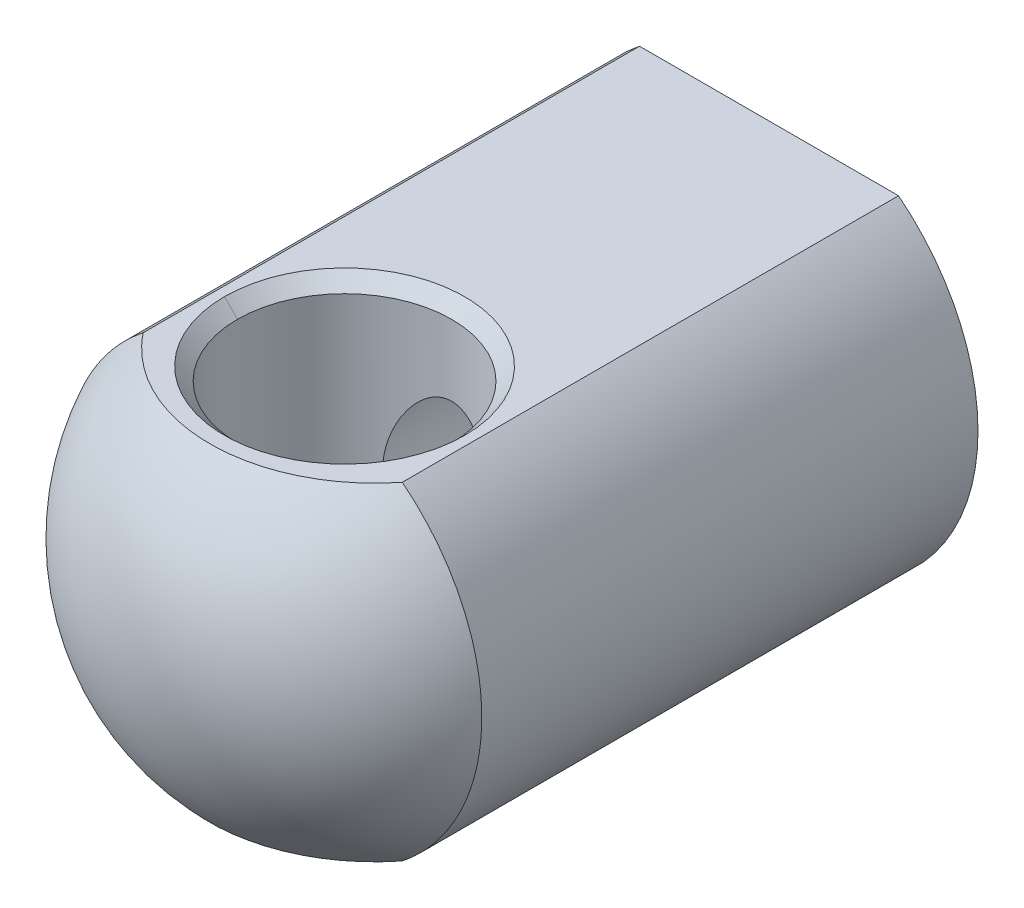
ISO-10303-21;
HEADER;
FILE_DESCRIPTION(('STEP AP214'),'2;1');
FILE_NAME('part.step','',(''),(''),'','','');
FILE_SCHEMA(('AUTOMOTIVE_DESIGN { 1 0 10303 214 1 1 1 1 }'));
ENDSEC;
DATA;
#1=APPLICATION_CONTEXT('core data for automotive mechanical design processes');
#2=APPLICATION_PROTOCOL_DEFINITION('international standard','automotive_design',2000,#1);
#3=PRODUCT_CONTEXT('',#1,'mechanical');
#4=PRODUCT('Part','Part','',(#3));
#5=PRODUCT_RELATED_PRODUCT_CATEGORY('part','',(#4));
#6=PRODUCT_DEFINITION_FORMATION('','',#4);
#7=PRODUCT_DEFINITION_CONTEXT('part definition',#1,'design');
#8=PRODUCT_DEFINITION('design','',#6,#7);
#9=PRODUCT_DEFINITION_SHAPE('','',#8);
#10=(LENGTH_UNIT() NAMED_UNIT(*) SI_UNIT(.MILLI.,.METRE.));
#11=(NAMED_UNIT(*) PLANE_ANGLE_UNIT() SI_UNIT($,.RADIAN.));
#12=(NAMED_UNIT(*) SI_UNIT($,.STERADIAN.) SOLID_ANGLE_UNIT());
#13=UNCERTAINTY_MEASURE_WITH_UNIT(LENGTH_MEASURE(1.E-05),#10,'distance_accuracy_value','');
#14=(GEOMETRIC_REPRESENTATION_CONTEXT(3) GLOBAL_UNCERTAINTY_ASSIGNED_CONTEXT((#13)) GLOBAL_UNIT_ASSIGNED_CONTEXT((#10,
#11,#12)) REPRESENTATION_CONTEXT('',''));
#15=CARTESIAN_POINT('',(0.,0.,0.));
#16=DIRECTION('',(0.,0.,1.));
#17=DIRECTION('',(1.,0.,0.));
#18=AXIS2_PLACEMENT_3D('',#15,#16,#17);
#19=CARTESIAN_POINT('',(0.,0.,12.0000000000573));
#20=DIRECTION('',(0.,0.,-1.));
#21=DIRECTION('',(-1.,0.,0.));
#22=AXIS2_PLACEMENT_3D('',#19,#20,#21);
#23=CONICAL_SURFACE('',#22,3.32349999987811,1.04719755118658);
#24=CARTESIAN_POINT('',(0.,0.,12.));
#25=DIRECTION('',(0.,0.,1.));
#26=DIRECTION('',(1.,0.,0.));
#27=AXIS2_PLACEMENT_3D('',#24,#25,#26);
#28=CIRCLE('',#27,3.3235);
#29=CARTESIAN_POINT('',(3.3235,0.,12.));
#30=VERTEX_POINT('',#29);
#31=EDGE_CURVE('E110',#30,#30,#28,.F.);
#32=ORIENTED_EDGE('',*,*,#31,.T.);
#33=EDGE_LOOP('',(#32));
#34=FACE_BOUND('',#33,.T.);
#35=CARTESIAN_POINT('',(-1.9422381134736,-1.06104954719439,12.641050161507));
#36=CARTESIAN_POINT('',(-1.89124629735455,-1.25349586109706,12.6136144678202));
#37=CARTESIAN_POINT('',(-1.82607894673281,-1.44171495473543,12.5798757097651));
#38=CARTESIAN_POINT('',(-1.70671942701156,-1.71321062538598,12.5236891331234));
#39=CARTESIAN_POINT('',(-1.66326200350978,-1.80201034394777,12.5040017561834));
#40=CARTESIAN_POINT('',(-1.56878879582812,-1.97520268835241,12.4634834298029));
#41=CARTESIAN_POINT('',(-1.51777795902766,-2.05959815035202,12.4426532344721));
#42=CARTESIAN_POINT('',(-1.39496608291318,-2.24189212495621,12.3957475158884));
#43=CARTESIAN_POINT('',(-1.3210868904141,-2.33838471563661,12.3695755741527));
#44=CARTESIAN_POINT('',(-1.16012089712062,-2.51995010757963,12.3184786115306));
#45=CARTESIAN_POINT('',(-1.07306202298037,-2.60504635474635,12.2935510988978));
#46=CARTESIAN_POINT('',(-0.908377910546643,-2.739804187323,12.2530628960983));
#47=CARTESIAN_POINT('',(-0.833861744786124,-2.7930003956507,12.2367208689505));
#48=CARTESIAN_POINT('',(-0.676955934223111,-2.88742181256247,12.2073163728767));
#49=CARTESIAN_POINT('',(-0.594577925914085,-2.92866435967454,12.1942491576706));
#50=CARTESIAN_POINT('',(-0.439454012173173,-2.98941158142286,12.1748464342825));
#51=CARTESIAN_POINT('',(-0.367852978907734,-3.0115579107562,12.1677035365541));
#52=CARTESIAN_POINT('',(-0.221757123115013,-3.04409822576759,12.1571759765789));
#53=CARTESIAN_POINT('',(-0.147264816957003,-3.0545022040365,12.1537881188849));
#54=CARTESIAN_POINT('',(0.00270995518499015,-3.06263798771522,12.1511406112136));
#55=CARTESIAN_POINT('',(0.0781946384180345,-3.06033358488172,12.1518927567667));
#56=CARTESIAN_POINT('',(0.227573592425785,-3.04318956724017,12.1574645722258));
#57=CARTESIAN_POINT('',(0.301467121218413,-3.0283442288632,12.1622860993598));
#58=CARTESIAN_POINT('',(0.443311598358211,-2.98808432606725,12.1752610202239));
#59=CARTESIAN_POINT('',(0.511377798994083,-2.96303066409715,12.1833004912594));
#60=CARTESIAN_POINT('',(0.643107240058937,-2.90404794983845,12.2020312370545));
#61=CARTESIAN_POINT('',(0.706768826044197,-2.87011558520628,12.2127235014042));
#62=CARTESIAN_POINT('',(0.866600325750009,-2.77208503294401,12.2432007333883));
#63=CARTESIAN_POINT('',(0.95892741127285,-2.7022080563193,12.2645550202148));
#64=CARTESIAN_POINT('',(1.13109657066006,-2.54913191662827,12.3099254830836));
#65=CARTESIAN_POINT('',(1.21089837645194,-2.46589145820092,12.333949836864));
#66=CARTESIAN_POINT('',(1.39652798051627,-2.2450094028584,12.3951993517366));
#67=CARTESIAN_POINT('',(1.49490538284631,-2.10125601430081,12.4329148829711));
#68=CARTESIAN_POINT('',(1.66795136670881,-1.79964016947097,12.5052695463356));
#69=CARTESIAN_POINT('',(1.74259420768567,-1.64176263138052,12.5399053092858));
#70=CARTESIAN_POINT('',(1.87218703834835,-1.30956180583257,12.6034933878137));
#71=CARTESIAN_POINT('',(1.92625169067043,-1.13483665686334,12.6321701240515));
#72=CARTESIAN_POINT('',(1.98948282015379,-0.867608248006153,12.6667876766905));
#73=CARTESIAN_POINT('',(2.00758475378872,-0.777649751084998,12.6769289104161));
#74=CARTESIAN_POINT('',(2.03779297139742,-0.596442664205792,12.6940599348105));
#75=CARTESIAN_POINT('',(2.04990101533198,-0.505194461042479,12.7010506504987));
#76=CARTESIAN_POINT('',(2.0693516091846,-0.308992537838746,12.7123456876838));
#77=CARTESIAN_POINT('',(2.07578345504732,-0.203917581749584,12.7161333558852));
#78=CARTESIAN_POINT('',(2.08073223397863,0.00650787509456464,12.7190434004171));
#79=CARTESIAN_POINT('',(2.07924732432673,0.111858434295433,12.7181646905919));
#80=CARTESIAN_POINT('',(2.06838108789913,0.321820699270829,12.7117935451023));
#81=CARTESIAN_POINT('',(2.05901354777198,0.426433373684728,12.7063091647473));
#82=CARTESIAN_POINT('',(2.03246864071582,0.634293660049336,12.6910260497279));
#83=CARTESIAN_POINT('',(2.0152958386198,0.73754203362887,12.6812298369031));
#84=CARTESIAN_POINT('',(1.98661435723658,0.876920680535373,12.6652636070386));
#85=CARTESIAN_POINT('',(1.97845378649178,0.913957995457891,12.6607521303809));
#86=CARTESIAN_POINT('',(1.96111235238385,0.987730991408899,12.651253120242));
#87=CARTESIAN_POINT('',(1.95193135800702,1.02446663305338,12.6462655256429));
#88=CARTESIAN_POINT('',(1.89124630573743,1.25349583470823,12.6136144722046));
#89=CARTESIAN_POINT('',(1.82607895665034,1.44171492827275,12.5798757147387));
#90=CARTESIAN_POINT('',(1.70671943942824,1.71321059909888,12.5236891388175));
#91=CARTESIAN_POINT('',(1.66326201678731,1.80201031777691,12.5040017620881));
#92=CARTESIAN_POINT('',(1.56878881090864,1.97520266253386,12.4634834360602));
#93=CARTESIAN_POINT('',(1.51777797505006,2.05959812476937,12.4426532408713));
#94=CARTESIAN_POINT('',(1.39496609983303,2.24189210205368,12.3957475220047));
#95=CARTESIAN_POINT('',(1.32108690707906,2.33838469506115,12.3695755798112));
#96=CARTESIAN_POINT('',(1.16012091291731,2.51995009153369,12.3184786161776));
#97=CARTESIAN_POINT('',(1.07306203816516,2.60504634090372,12.2935511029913));
#98=CARTESIAN_POINT('',(0.908377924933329,2.73980417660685,12.2530628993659));
#99=CARTESIAN_POINT('',(0.833861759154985,2.79300038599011,12.2367208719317));
#100=CARTESIAN_POINT('',(0.676955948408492,2.88742180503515,12.2073163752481));
#101=CARTESIAN_POINT('',(0.594577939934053,2.92866435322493,12.1942491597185));
#102=CARTESIAN_POINT('',(0.439454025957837,2.98941157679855,12.1748464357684));
#103=CARTESIAN_POINT('',(0.367852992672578,3.01155790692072,12.167703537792));
#104=CARTESIAN_POINT('',(0.221757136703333,3.04409822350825,12.1571759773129));
#105=CARTESIAN_POINT('',(0.147264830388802,3.05450220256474,12.1537881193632));
#106=CARTESIAN_POINT('',(-0.00270994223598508,3.06263798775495,12.1511406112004));
#107=CARTESIAN_POINT('',(-0.0781946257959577,3.06033358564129,12.1518927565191));
#108=CARTESIAN_POINT('',(-0.227573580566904,3.04318956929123,12.15746457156));
#109=CARTESIAN_POINT('',(-0.301467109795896,3.02834423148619,12.1622860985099));
#110=CARTESIAN_POINT('',(-0.443311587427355,2.98808432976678,12.1752610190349));
#111=CARTESIAN_POINT('',(-0.511377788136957,2.96303066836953,12.1833004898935));
#112=CARTESIAN_POINT('',(-0.64310722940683,2.90404795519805,12.2020312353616));
#113=CARTESIAN_POINT('',(-0.706768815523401,2.87011559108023,12.2127234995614));
#114=CARTESIAN_POINT('',(-0.866600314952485,2.77208504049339,12.2432007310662));
#115=CARTESIAN_POINT('',(-0.958927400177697,2.7022080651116,12.2645550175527));
#116=CARTESIAN_POINT('',(-1.13109655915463,2.54913192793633,12.3099254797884));
#117=CARTESIAN_POINT('',(-1.21089836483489,2.46589147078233,12.3339498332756));
#118=CARTESIAN_POINT('',(-1.39652796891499,2.24500941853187,12.3951993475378));
#119=CARTESIAN_POINT('',(-1.4949053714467,2.10125603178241,12.4329148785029));
#120=CARTESIAN_POINT('',(-1.66795135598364,1.79964019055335,12.5052695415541));
#121=CARTESIAN_POINT('',(-1.74259419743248,1.64176265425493,12.5399053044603));
#122=CARTESIAN_POINT('',(-1.87218702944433,1.30956183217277,12.6034933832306));
#123=CARTESIAN_POINT('',(-1.92625168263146,1.13483668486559,12.6321701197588));
#124=CARTESIAN_POINT('',(-1.9894828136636,0.86760827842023,12.6667876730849));
#125=CARTESIAN_POINT('',(-2.00758474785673,0.77764978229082,12.6769289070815));
#126=CARTESIAN_POINT('',(-2.03779296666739,0.596442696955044,12.694059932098));
#127=CARTESIAN_POINT('',(-2.04990101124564,0.505194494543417,12.7010506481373));
#128=CARTESIAN_POINT('',(-2.06935160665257,0.308992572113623,12.7123456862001));
#129=CARTESIAN_POINT('',(-2.07578345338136,0.203917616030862,12.7161333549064));
#130=CARTESIAN_POINT('',(-2.080732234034,-0.00650784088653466,12.7190434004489));
#131=CARTESIAN_POINT('',(-2.07924732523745,-0.11185840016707,12.7181646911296));
#132=CARTESIAN_POINT('',(-2.06838109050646,-0.32182066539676,12.7117935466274));
#133=CARTESIAN_POINT('',(-2.05901355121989,-0.426433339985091,12.7063091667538));
#134=CARTESIAN_POINT('',(-2.03246864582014,-0.634293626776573,12.6910260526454));
#135=CARTESIAN_POINT('',(-2.01529584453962,-0.737542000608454,12.6812298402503));
#136=CARTESIAN_POINT('',(-1.98661436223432,-0.876920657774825,12.6652636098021));
#137=CARTESIAN_POINT('',(-1.9784537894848,-0.913957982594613,12.6607521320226));
#138=CARTESIAN_POINT('',(-1.96111235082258,-0.987730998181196,12.6512531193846));
#139=CARTESIAN_POINT('',(-1.95193135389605,-1.02446664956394,12.6462655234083));
#140=CARTESIAN_POINT('',(-1.9422381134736,-1.06104954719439,12.641050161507));
#141=B_SPLINE_CURVE_WITH_KNOTS('',3,(#35,#36,#37,#38,#39,#40,#41,#42,#43,#44,#45,#46,#47,#48,
#49,#50,#51,#52,#53,#54,#55,#56,#57,#58,#59,#60,#61,#62,#63,#64,#65,#66,#67,#68,#69,#70,#71,#72,
#73,#74,#75,#76,#77,#78,#79,#80,#81,#82,#83,#84,#85,#86,#87,#88,#89,#90,#91,#92,#93,#94,#95,#96,
#97,#98,#99,#100,#101,#102,#103,#104,#105,#106,#107,#108,#109,#110,#111,#112,#113,#114,#115,
#116,#117,#118,#119,#120,#121,#122,#123,#124,#125,#126,#127,#128,#129,#130,#131,#132,#133,#134,
#135,#136,#137,#138,#139,#140),.UNSPECIFIED.,.T.,.F.,(4,2,2,2,2,2,2,2,2,2,2,2,2,2,2,2,2,2,2,2,2,
2,2,2,2,2,2,2,2,2,2,2,2,2,2,2,2,2,2,2,2,2,2,2,2,2,2,2,2,2,2,2,4),(0.,0.602741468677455,
0.9048864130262,1.2068343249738,1.57878856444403,1.94996541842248,2.22806229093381,
2.50575374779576,2.73066940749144,2.95539352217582,3.18075824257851,3.40622587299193,
3.62433214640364,3.84251990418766,4.19372693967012,4.54604092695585,5.07782618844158,
5.61018622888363,6.1633872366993,6.44014079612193,6.71681304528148,7.03243008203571,
7.34812058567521,7.66326009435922,7.97821553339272,8.09277833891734,8.20735587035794,
8.8100973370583,9.11224228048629,9.41419019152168,9.78614443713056,10.1573212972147,
10.4354181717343,10.7131096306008,10.9380252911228,11.1627494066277,11.3881141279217,
11.6135817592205,11.831688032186,12.0498757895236,12.4010828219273,12.7533968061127,
13.2851820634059,13.8175420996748,14.3707431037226,14.6474966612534,14.9241689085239,
15.2397859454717,15.555476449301,15.8706159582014,16.185571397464,16.3001342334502,
16.4147117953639),.UNSPECIFIED.);
#142=CARTESIAN_POINT('',(-1.9422381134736,-1.06104954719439,12.641050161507));
#143=VERTEX_POINT('',#142);
#144=EDGE_CURVE('E20',#143,#143,#141,.T.);
#145=ORIENTED_EDGE('',*,*,#144,.T.);
#146=EDGE_LOOP('',(#145));
#147=FACE_BOUND('',#146,.T.);
#148=ADVANCED_FACE('F16',(#34,#147),#23,.F.);
#149=CARTESIAN_POINT('',(0.,-1.52129784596,16.25182724));
#150=DIRECTION('',(0.,1.,0.));
#151=DIRECTION('',(0.,0.,1.));
#152=AXIS2_PLACEMENT_3D('',#149,#150,#151);
#153=CYLINDRICAL_SURFACE('',#152,4.1);
#154=CARTESIAN_POINT('',(0.,5.77740430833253,16.2518272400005));
#155=DIRECTION('',(0.,1.,1.20792265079E-13));
#156=DIRECTION('',(-1.,0.,0.));
#157=AXIS2_PLACEMENT_3D('',#154,#155,#156);
#158=CIRCLE('',#157,4.10000000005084);
#159=CARTESIAN_POINT('',(4.10000000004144,5.77740430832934,16.25182724));
#160=VERTEX_POINT('',#159);
#161=CARTESIAN_POINT('',(-4.10000000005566,5.77740430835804,16.2518272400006));
#162=VERTEX_POINT('',#161);
#163=EDGE_CURVE('E81',#160,#162,#158,.T.);
#164=ORIENTED_EDGE('',*,*,#163,.T.);
#165=CARTESIAN_POINT('',(0.,5.77740430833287,16.2518272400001));
#166=DIRECTION('',(0.,1.,0.));
#167=DIRECTION('',(0.994796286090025,0.,-0.101883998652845));
#168=AXIS2_PLACEMENT_3D('',#165,#166,#167);
#169=CIRCLE('',#168,4.1000000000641);
#170=EDGE_CURVE('E113',#162,#160,#169,.T.);
#171=ORIENTED_EDGE('',*,*,#170,.T.);
#172=EDGE_LOOP('',(#164,#171));
#173=FACE_BOUND('',#172,.T.);
#174=ORIENTED_EDGE('',*,*,#144,.F.);
#175=EDGE_LOOP('',(#174));
#176=FACE_BOUND('',#175,.T.);
#177=CARTESIAN_POINT('',(0.,-5.77740430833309,16.2518272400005));
#178=DIRECTION('',(0.,-1.,1.20792265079E-13));
#179=DIRECTION('',(0.933248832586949,0.,0.359230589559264));
#180=AXIS2_PLACEMENT_3D('',#177,#178,#179);
#181=CIRCLE('',#180,4.10000000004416);
#182=CARTESIAN_POINT('',(-4.10000000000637,-5.77740430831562,16.25182724));
#183=VERTEX_POINT('',#182);
#184=CARTESIAN_POINT('',(4.10000000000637,-5.77740430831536,16.25182724));
#185=VERTEX_POINT('',#184);
#186=EDGE_CURVE('E94',#183,#185,#181,.T.);
#187=ORIENTED_EDGE('',*,*,#186,.T.);
#188=CARTESIAN_POINT('',(0.,-5.77740430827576,16.2518272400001));
#189=DIRECTION('',(0.,-1.,0.));
#190=DIRECTION('',(-1.,0.,0.));
#191=AXIS2_PLACEMENT_3D('',#188,#189,#190);
#192=CIRCLE('',#191,4.09999999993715);
#193=EDGE_CURVE('E91',#185,#183,#192,.T.);
#194=ORIENTED_EDGE('',*,*,#193,.T.);
#195=EDGE_LOOP('',(#187,#194));
#196=FACE_BOUND('',#195,.T.);
#197=ADVANCED_FACE('F95',(#173,#176,#196),#153,.F.);
#198=CARTESIAN_POINT('',(0.,-6.27740430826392,16.2518272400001));
#199=DIRECTION('',(0.,-1.,0.));
#200=DIRECTION('',(1.,0.,0.));
#201=AXIS2_PLACEMENT_3D('',#198,#199,#200);
#202=CONICAL_SURFACE('',#201,4.59999999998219,0.785398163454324);
#203=ORIENTED_EDGE('',*,*,#193,.F.);
#204=CARTESIAN_POINT('',(4.10000000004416,-5.7774043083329,16.25182724));
#205=CARTESIAN_POINT('',(4.1208333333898,-5.7982376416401,16.2518272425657));
#206=CARTESIAN_POINT('',(4.14166666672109,-5.81907097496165,16.2518272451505));
#207=CARTESIAN_POINT('',(4.18333333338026,-5.8607376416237,16.2518272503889));
#208=CARTESIAN_POINT('',(4.20416666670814,-5.88157097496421,16.2518272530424));
#209=CARTESIAN_POINT('',(4.24583333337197,-5.92323764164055,16.251827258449));
#210=CARTESIAN_POINT('',(4.26666666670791,-5.94407097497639,16.251827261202));
#211=CARTESIAN_POINT('',(4.30833333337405,-5.98573764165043,16.2518272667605));
#212=CARTESIAN_POINT('',(4.32916666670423,-6.00657097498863,16.251827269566));
#213=CARTESIAN_POINT('',(4.37083333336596,-6.04823764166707,16.2518272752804));
#214=CARTESIAN_POINT('',(4.39166666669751,-6.06907097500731,16.2518272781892));
#215=CARTESIAN_POINT('',(4.43333333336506,-6.11073764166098,16.25182728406));
#216=CARTESIAN_POINT('',(4.45416666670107,-6.13157097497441,16.251827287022));
#217=CARTESIAN_POINT('',(4.49583333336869,-6.17323764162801,16.251827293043));
#218=CARTESIAN_POINT('',(4.5166666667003,-6.19407097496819,16.2518272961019));
#219=CARTESIAN_POINT('',(4.55833333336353,-6.23573764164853,16.2518273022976));
#220=CARTESIAN_POINT('',(4.57916666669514,-6.25657097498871,16.2518273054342));
#221=CARTESIAN_POINT('',(4.60000000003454,-6.2774043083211,16.2518273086));
#222=B_SPLINE_CURVE_WITH_KNOTS('',3,(#204,#205,#206,#207,#208,#209,#210,#211,#212,#213,#214,
#215,#216,#217,#218,#219,#220,#221),.UNSPECIFIED.,.F.,.F.,(4,2,2,2,2,2,2,2,4),(0.,
0.088388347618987,0.176776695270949,0.26516504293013,0.353553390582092,0.441941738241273,
0.530330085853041,0.618718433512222,0.707106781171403),.UNSPECIFIED.);
#223=CARTESIAN_POINT('',(4.60000000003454,-6.2774043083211,16.2518273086));
#224=VERTEX_POINT('',#223);
#225=EDGE_CURVE('E99',#185,#224,#222,.T.);
#226=ORIENTED_EDGE('',*,*,#225,.T.);
#227=CARTESIAN_POINT('',(0.,-6.27740430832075,16.2518272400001));
#228=DIRECTION('',(0.,-1.,0.));
#229=DIRECTION('',(1.,0.,0.));
#230=AXIS2_PLACEMENT_3D('',#227,#228,#229);
#231=CIRCLE('',#230,4.60000000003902);
#232=CARTESIAN_POINT('',(-4.60000000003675,-6.27740430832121,16.25182724));
#233=VERTEX_POINT('',#232);
#234=EDGE_CURVE('E218',#224,#233,#231,.T.);
#235=ORIENTED_EDGE('',*,*,#234,.T.);
#236=CARTESIAN_POINT('',(-4.60000000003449,-6.27740430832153,16.25182724));
#237=CARTESIAN_POINT('',(-4.5791666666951,-6.25657097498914,16.2518272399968));
#238=CARTESIAN_POINT('',(-4.55833333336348,-6.23573764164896,16.2518272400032));
#239=CARTESIAN_POINT('',(-4.51666666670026,-6.19407097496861,16.2518272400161));
#240=CARTESIAN_POINT('',(-4.49583333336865,-6.17323764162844,16.2518272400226));
#241=CARTESIAN_POINT('',(-4.45416666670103,-6.13157097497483,16.2518272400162));
#242=CARTESIAN_POINT('',(-4.43333333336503,-6.1107376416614,16.2518272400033));
#243=CARTESIAN_POINT('',(-4.39166666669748,-6.06907097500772,16.2518272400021));
#244=CARTESIAN_POINT('',(-4.37083333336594,-6.04823764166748,16.2518272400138));
#245=CARTESIAN_POINT('',(-4.32916666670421,-6.00657097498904,16.2518272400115));
#246=CARTESIAN_POINT('',(-4.30833333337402,-5.98573764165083,16.2518272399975));
#247=CARTESIAN_POINT('',(-4.2666666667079,-5.94407097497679,16.2518272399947));
#248=CARTESIAN_POINT('',(-4.24583333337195,-5.92323764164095,16.2518272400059));
#249=CARTESIAN_POINT('',(-4.20416666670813,-5.8815709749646,16.2518272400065));
#250=CARTESIAN_POINT('',(-4.18333333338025,-5.8607376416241,16.2518272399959));
#251=CARTESIAN_POINT('',(-4.14166666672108,-5.81907097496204,16.2518272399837));
#252=CARTESIAN_POINT('',(-4.1208333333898,-5.79823764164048,16.251827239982));
#253=CARTESIAN_POINT('',(-4.10000000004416,-5.77740430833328,16.25182724));
#254=B_SPLINE_CURVE_WITH_KNOTS('',3,(#236,#237,#238,#239,#240,#241,#242,#243,#244,#245,#246,
#247,#248,#249,#250,#251,#252,#253),.UNSPECIFIED.,.F.,.F.,(4,2,2,2,2,2,2,2,4),(0.,
0.0883883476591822,0.176776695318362,0.265165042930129,0.353553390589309,0.441941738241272,
0.530330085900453,0.618718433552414,0.7071067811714),.UNSPECIFIED.);
#255=EDGE_CURVE('E100',#233,#183,#254,.T.);
#256=ORIENTED_EDGE('',*,*,#255,.T.);
#257=EDGE_LOOP('',(#203,#226,#235,#256));
#258=FACE_BOUND('',#257,.T.);
#259=ADVANCED_FACE('F103',(#258),#202,.F.);
#260=CARTESIAN_POINT('',(0.,-6.27740430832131,16.2518272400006));
#261=DIRECTION('',(0.,-1.,1.20876363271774E-13));
#262=DIRECTION('',(0.,-1.20876363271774E-13,-1.));
#263=AXIS2_PLACEMENT_3D('',#260,#261,#262);
#264=CONICAL_SURFACE('',#263,4.60000000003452,0.785398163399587);
#265=ORIENTED_EDGE('',*,*,#186,.F.);
#266=ORIENTED_EDGE('',*,*,#255,.F.);
#267=CARTESIAN_POINT('',(0.,-6.27740430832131,16.2518272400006));
#268=DIRECTION('',(0.,-1.,1.20876363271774E-13));
#269=DIRECTION('',(0.,-1.20876363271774E-13,-1.));
#270=AXIS2_PLACEMENT_3D('',#267,#268,#269);
#271=CIRCLE('',#270,4.60000000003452);
#272=EDGE_CURVE('E108',#233,#224,#271,.T.);
#273=ORIENTED_EDGE('',*,*,#272,.T.);
#274=ORIENTED_EDGE('',*,*,#225,.F.);
#275=EDGE_LOOP('',(#265,#266,#273,#274));
#276=FACE_BOUND('',#275,.T.);
#277=ADVANCED_FACE('F106',(#276),#264,.F.);
#278=CARTESIAN_POINT('',(0.,0.,0.1));
#279=DIRECTION('',(0.,0.,1.));
#280=DIRECTION('',(1.,0.,0.));
#281=AXIS2_PLACEMENT_3D('',#278,#279,#280);
#282=CYLINDRICAL_SURFACE('',#281,3.3235);
#283=ORIENTED_EDGE('',*,*,#31,.F.);
#284=EDGE_LOOP('',(#283));
#285=FACE_BOUND('',#284,.T.);
#286=CARTESIAN_POINT('',(0.,0.,0.));
#287=DIRECTION('',(0.,0.,1.));
#288=DIRECTION('',(1.,0.,0.));
#289=AXIS2_PLACEMENT_3D('',#286,#287,#288);
#290=CIRCLE('',#289,3.3235);
#291=CARTESIAN_POINT('',(3.3235,0.,0.));
#292=VERTEX_POINT('',#291);
#293=EDGE_CURVE('E173',#292,#292,#290,.F.);
#294=ORIENTED_EDGE('',*,*,#293,.T.);
#295=EDGE_LOOP('',(#294));
#296=FACE_BOUND('',#295,.T.);
#297=ADVANCED_FACE('F132',(#285,#296),#282,.F.);
#298=CARTESIAN_POINT('',(0.,0.,12.));
#299=DIRECTION('',(0.,0.,1.));
#300=DIRECTION('',(1.,0.,0.));
#301=AXIS2_PLACEMENT_3D('',#298,#299,#300);
#302=CYLINDRICAL_SURFACE('',#301,8.);
#303=CARTESIAN_POINT('',(0.,0.,0.));
#304=DIRECTION('',(0.,0.,1.));
#305=DIRECTION('',(1.,0.,0.));
#306=AXIS2_PLACEMENT_3D('',#303,#304,#305);
#307=CIRCLE('',#306,8.);
#308=CARTESIAN_POINT('',(-4.95925348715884,6.27740430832,0.));
#309=VERTEX_POINT('',#308);
#310=CARTESIAN_POINT('',(-4.95925348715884,-6.27740430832,0.));
#311=VERTEX_POINT('',#310);
#312=EDGE_CURVE('E220',#309,#311,#307,.T.);
#313=ORIENTED_EDGE('',*,*,#312,.T.);
#314=DIRECTION('',(0.,0.,1.));
#315=VECTOR('',#314,1.);
#316=CARTESIAN_POINT('',(-4.95925348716,-6.27740430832,0.));
#317=LINE('',#316,#315);
#318=CARTESIAN_POINT('',(-4.95925348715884,-6.27740430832,19.));
#319=VERTEX_POINT('',#318);
#320=EDGE_CURVE('E195',#311,#319,#317,.T.);
#321=ORIENTED_EDGE('',*,*,#320,.T.);
#322=CARTESIAN_POINT('',(0.,0.,19.));
#323=DIRECTION('',(0.,0.,1.));
#324=DIRECTION('',(1.,0.,0.));
#325=AXIS2_PLACEMENT_3D('',#322,#323,#324);
#326=CIRCLE('',#325,8.);
#327=CARTESIAN_POINT('',(-4.95925348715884,6.27740430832,19.));
#328=VERTEX_POINT('',#327);
#329=EDGE_CURVE('E73',#328,#319,#326,.T.);
#330=ORIENTED_EDGE('',*,*,#329,.F.);
#331=DIRECTION('',(0.,0.,-1.));
#332=VECTOR('',#331,1.);
#333=CARTESIAN_POINT('',(-4.95925348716,6.27740430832,0.));
#334=LINE('',#333,#332);
#335=EDGE_CURVE('E172',#328,#309,#334,.T.);
#336=ORIENTED_EDGE('',*,*,#335,.T.);
#337=EDGE_LOOP('',(#313,#321,#330,#336));
#338=FACE_BOUND('',#337,.T.);
#339=ADVANCED_FACE('F238',(#338),#302,.T.);
#340=CARTESIAN_POINT('',(0.,6.27740430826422,16.2518272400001));
#341=DIRECTION('',(0.,1.,0.));
#342=DIRECTION('',(-1.,0.,0.));
#343=AXIS2_PLACEMENT_3D('',#340,#341,#342);
#344=CONICAL_SURFACE('',#343,4.59999999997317,0.785398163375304);
#345=CARTESIAN_POINT('',(0.,6.27740430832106,16.2518272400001));
#346=DIRECTION('',(0.,1.,0.));
#347=DIRECTION('',(-1.,0.,0.));
#348=AXIS2_PLACEMENT_3D('',#345,#346,#347);
#349=CIRCLE('',#348,4.60000000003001);
#350=CARTESIAN_POINT('',(-4.60000000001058,6.27740430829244,16.2518272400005));
#351=VERTEX_POINT('',#350);
#352=CARTESIAN_POINT('',(4.60000000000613,6.27740430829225,16.2518273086));
#353=VERTEX_POINT('',#352);
#354=EDGE_CURVE('E163',#351,#353,#349,.T.);
#355=ORIENTED_EDGE('',*,*,#354,.T.);
#356=CARTESIAN_POINT('',(4.59999999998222,6.27740430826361,16.2518273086));
#357=CARTESIAN_POINT('',(4.5791666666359,6.25657097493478,16.251827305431));
#358=CARTESIAN_POINT('',(4.55833333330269,6.23573764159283,16.2518273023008));
#359=CARTESIAN_POINT('',(4.51666666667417,6.19407097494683,16.2518272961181));
#360=CARTESIAN_POINT('',(4.49583333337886,6.17323764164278,16.2518272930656));
#361=CARTESIAN_POINT('',(4.45416666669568,6.13157097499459,16.2518272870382));
#362=CARTESIAN_POINT('',(4.43333333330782,6.11073764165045,16.2518272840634));
#363=CARTESIAN_POINT('',(4.39166666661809,6.06907097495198,16.2518272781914));
#364=CARTESIAN_POINT('',(4.37083333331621,6.04823764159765,16.2518272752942));
#365=CARTESIAN_POINT('',(4.32916666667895,6.00657097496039,16.2518272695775));
#366=CARTESIAN_POINT('',(4.30833333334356,5.98573764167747,16.251827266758));
#367=CARTESIAN_POINT('',(4.26666666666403,5.9440709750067,16.2518272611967));
#368=CARTESIAN_POINT('',(4.24583333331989,5.92323764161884,16.2518272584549));
#369=CARTESIAN_POINT('',(4.20416666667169,5.88157097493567,16.2518272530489));
#370=CARTESIAN_POINT('',(4.18333333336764,5.86073764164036,16.2518272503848));
#371=CARTESIAN_POINT('',(4.14166666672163,5.81907097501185,16.2518272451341));
#372=CARTESIAN_POINT('',(4.12083333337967,5.79823764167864,16.2518272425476));
#373=CARTESIAN_POINT('',(4.10000000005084,5.77740430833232,16.25182724));
#374=B_SPLINE_CURVE_WITH_KNOTS('',3,(#356,#357,#358,#359,#360,#361,#362,#363,#364,#365,#366,
#367,#368,#369,#370,#371,#372,#373),.UNSPECIFIED.,.F.,.F.,(4,2,2,2,2,2,2,2,4),(0.,
0.0883883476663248,0.176776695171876,0.265165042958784,0.353553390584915,0.441941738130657,
0.530330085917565,0.618718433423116,0.707106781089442),.UNSPECIFIED.);
#375=EDGE_CURVE('E200',#353,#160,#374,.T.);
#376=ORIENTED_EDGE('',*,*,#375,.T.);
#377=ORIENTED_EDGE('',*,*,#170,.F.);
#378=DIRECTION('',(0.707106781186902,-0.707106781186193,0.));
#379=VECTOR('',#378,1.);
#380=CARTESIAN_POINT('',(-498998.322596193,499000.,16.2518272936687));
#381=LINE('',#380,#379);
#382=EDGE_CURVE('E148',#162,#351,#381,.F.);
#383=ORIENTED_EDGE('',*,*,#382,.T.);
#384=EDGE_LOOP('',(#355,#376,#377,#383));
#385=FACE_BOUND('',#384,.T.);
#386=ADVANCED_FACE('F287',(#385),#344,.F.);
#387=CARTESIAN_POINT('',(0.,6.27740430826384,16.2518272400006));
#388=DIRECTION('',(0.,1.,1.20864972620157E-13));
#389=DIRECTION('',(0.,-1.20864972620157E-13,1.));
#390=AXIS2_PLACEMENT_3D('',#387,#388,#389);
#391=CONICAL_SURFACE('',#390,4.5999999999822,0.785398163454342);
#392=CARTESIAN_POINT('',(0.,6.27740430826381,16.2518272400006));
#393=DIRECTION('',(0.,1.,1.20864972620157E-13));
#394=DIRECTION('',(0.,-1.20864972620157E-13,1.));
#395=AXIS2_PLACEMENT_3D('',#392,#393,#394);
#396=CIRCLE('',#395,4.59999999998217);
#397=EDGE_CURVE('E160',#353,#351,#396,.T.);
#398=ORIENTED_EDGE('',*,*,#397,.T.);
#399=ORIENTED_EDGE('',*,*,#382,.F.);
#400=ORIENTED_EDGE('',*,*,#163,.F.);
#401=ORIENTED_EDGE('',*,*,#375,.F.);
#402=EDGE_LOOP('',(#398,#399,#400,#401));
#403=FACE_BOUND('',#402,.T.);
#404=ADVANCED_FACE('F186',(#403),#391,.F.);
#405=CARTESIAN_POINT('',(0.,0.,15.1));
#406=DIRECTION('',(0.877582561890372,-0.479425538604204,0.));
#407=DIRECTION('',(-0.479425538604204,-0.877582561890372,0.));
#408=AXIS2_PLACEMENT_3D('',#405,#406,#407);
#409=SPHERICAL_SURFACE('',#408,8.9);
#410=ORIENTED_EDGE('',*,*,#329,.T.);
#411=CARTESIAN_POINT('',(-4.95925348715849,-6.27740430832,18.999999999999));
#412=CARTESIAN_POINT('',(-4.84958041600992,-6.27740430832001,19.1394915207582));
#413=CARTESIAN_POINT('',(-4.73399534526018,-6.27740430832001,19.2743303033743));
#414=CARTESIAN_POINT('',(-4.49189084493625,-6.27740430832,19.5337940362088));
#415=CARTESIAN_POINT('',(-4.36537193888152,-6.27740430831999,19.658419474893));
#416=CARTESIAN_POINT('',(-4.10236962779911,-6.27740430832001,19.8964794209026));
#417=CARTESIAN_POINT('',(-3.96589316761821,-6.27740430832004,20.0099216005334));
#418=CARTESIAN_POINT('',(-3.68387435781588,-6.27740430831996,20.2249096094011));
#419=CARTESIAN_POINT('',(-3.53833211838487,-6.27740430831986,20.3264555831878));
#420=CARTESIAN_POINT('',(-3.23917115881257,-6.27740430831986,20.516956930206));
#421=CARTESIAN_POINT('',(-3.08555018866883,-6.27740430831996,20.6059087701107));
#422=CARTESIAN_POINT('',(-2.77130331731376,-6.27740430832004,20.770586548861));
#423=CARTESIAN_POINT('',(-2.61067484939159,-6.27740430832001,20.8463075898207));
#424=CARTESIAN_POINT('',(-2.28370090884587,-6.27740430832,20.9839059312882));
#425=CARTESIAN_POINT('',(-2.11735871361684,-6.27740430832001,21.0457910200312));
#426=CARTESIAN_POINT('',(-1.7799912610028,-6.27740430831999,21.1553524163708));
#427=CARTESIAN_POINT('',(-1.60896430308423,-6.27740430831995,21.2030234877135));
#428=CARTESIAN_POINT('',(-1.2635285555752,-6.27740430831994,21.2837810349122));
#429=CARTESIAN_POINT('',(-1.08912028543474,-6.27740430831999,21.3168697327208));
#430=CARTESIAN_POINT('',(-0.738132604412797,-6.27740430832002,21.3682384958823));
#431=CARTESIAN_POINT('',(-0.561553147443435,-6.27740430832,21.3865182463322));
#432=CARTESIAN_POINT('',(-0.207464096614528,-6.27740430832,21.4081390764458));
#433=CARTESIAN_POINT('',(-0.0299544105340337,-6.27740430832,21.4114786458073));
#434=CARTESIAN_POINT('',(0.324715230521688,-6.27740430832,21.403191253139));
#435=CARTESIAN_POINT('',(0.501875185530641,-6.27740430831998,21.3915642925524));
#436=CARTESIAN_POINT('',(0.854559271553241,-6.27740430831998,21.3534293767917));
#437=CARTESIAN_POINT('',(1.0300836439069,-6.27740430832,21.3269236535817));
#438=CARTESIAN_POINT('',(1.37827216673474,-6.27740430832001,21.2592219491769));
#439=CARTESIAN_POINT('',(1.55093637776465,-6.27740430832,21.2180262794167));
#440=CARTESIAN_POINT('',(1.89225020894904,-6.27740430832,21.1212177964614));
#441=CARTESIAN_POINT('',(2.06089817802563,-6.27740430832,21.065599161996));
#442=CARTESIAN_POINT('',(2.39284633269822,-6.27740430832,20.9403713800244));
#443=CARTESIAN_POINT('',(2.55614846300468,-6.27740430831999,20.8707673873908));
#444=CARTESIAN_POINT('',(2.8764593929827,-6.27740430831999,20.7179793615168));
#445=CARTESIAN_POINT('',(3.0334621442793,-6.27740430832,20.6347826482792));
#446=CARTESIAN_POINT('',(3.33983709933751,-6.27740430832,20.4554807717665));
#447=CARTESIAN_POINT('',(3.48921213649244,-6.27740430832,20.3593804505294));
#448=CARTESIAN_POINT('',(3.77919401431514,-6.27740430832,20.1550295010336));
#449=CARTESIAN_POINT('',(3.91980886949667,-6.27740430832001,20.0467902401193));
#450=CARTESIAN_POINT('',(4.19137166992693,-6.27740430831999,19.8188980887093));
#451=CARTESIAN_POINT('',(4.32232397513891,-6.27740430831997,19.6992504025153));
#452=CARTESIAN_POINT('',(4.53902052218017,-6.27740430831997,19.4838301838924));
#453=CARTESIAN_POINT('',(4.62727604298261,-6.27740430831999,19.3905679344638));
#454=CARTESIAN_POINT('',(4.79778729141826,-6.27740430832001,19.1990066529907));
#455=CARTESIAN_POINT('',(4.8800533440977,-6.27740430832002,19.1007168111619));
#456=CARTESIAN_POINT('',(4.95925348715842,-6.27740430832,18.999999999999));
#457=B_SPLINE_CURVE_WITH_KNOTS('',3,(#411,#412,#413,#414,#415,#416,#417,#418,#419,#420,#421,
#422,#423,#424,#425,#426,#427,#428,#429,#430,#431,#432,#433,#434,#435,#436,#437,#438,#439,#440,
#441,#442,#443,#444,#445,#446,#447,#448,#449,#450,#451,#452,#453,#454,#455,#456),.UNSPECIFIED.,
.F.,.F.,(4,2,2,2,2,2,2,2,2,2,2,2,2,2,2,2,2,2,2,2,2,2,4),(0.,0.532166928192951,1.06430838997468,
1.59608219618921,2.12784954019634,2.65976577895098,3.19187851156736,3.7236909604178,
4.25569908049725,4.78762610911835,5.31956444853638,5.85155656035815,6.38354862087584,
6.91546089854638,7.44736190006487,7.97947791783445,8.51139816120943,9.04381747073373,
9.57603754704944,10.1077633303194,10.6392477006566,11.0242247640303,11.4085216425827),.UNSPECIFIED.);
#458=CARTESIAN_POINT('',(4.95925348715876,-6.27740430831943,18.9999999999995));
#459=VERTEX_POINT('',#458);
#460=EDGE_CURVE('E213',#319,#459,#457,.T.);
#461=ORIENTED_EDGE('',*,*,#460,.T.);
#462=CARTESIAN_POINT('',(0.,0.,19.));
#463=DIRECTION('',(0.,0.,1.));
#464=DIRECTION('',(1.,0.,0.));
#465=AXIS2_PLACEMENT_3D('',#462,#463,#464);
#466=CIRCLE('',#465,8.);
#467=CARTESIAN_POINT('',(4.95925348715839,6.27740430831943,19.));
#468=VERTEX_POINT('',#467);
#469=EDGE_CURVE('E158',#468,#459,#466,.F.);
#470=ORIENTED_EDGE('',*,*,#469,.F.);
#471=CARTESIAN_POINT('',(4.95925348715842,6.27740430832,18.999999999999));
#472=CARTESIAN_POINT('',(4.84958041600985,6.27740430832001,19.1394915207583));
#473=CARTESIAN_POINT('',(4.73399534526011,6.27740430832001,19.2743303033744));
#474=CARTESIAN_POINT('',(4.49189084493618,6.27740430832,19.5337940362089));
#475=CARTESIAN_POINT('',(4.36537193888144,6.27740430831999,19.6584194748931));
#476=CARTESIAN_POINT('',(4.10236962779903,6.27740430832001,19.8964794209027));
#477=CARTESIAN_POINT('',(3.96589316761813,6.27740430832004,20.0099216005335));
#478=CARTESIAN_POINT('',(3.6838743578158,6.27740430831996,20.2249096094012));
#479=CARTESIAN_POINT('',(3.53833211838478,6.27740430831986,20.3264555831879));
#480=CARTESIAN_POINT('',(3.23917115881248,6.27740430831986,20.516956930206));
#481=CARTESIAN_POINT('',(3.08555018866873,6.27740430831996,20.6059087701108));
#482=CARTESIAN_POINT('',(2.77130331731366,6.27740430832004,20.7705865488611));
#483=CARTESIAN_POINT('',(2.61067484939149,6.27740430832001,20.8463075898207));
#484=CARTESIAN_POINT('',(2.28370090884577,6.27740430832,20.9839059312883));
#485=CARTESIAN_POINT('',(2.11735871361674,6.27740430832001,21.0457910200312));
#486=CARTESIAN_POINT('',(1.77999126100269,6.27740430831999,21.1553524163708));
#487=CARTESIAN_POINT('',(1.60896430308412,6.27740430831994,21.2030234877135));
#488=CARTESIAN_POINT('',(1.26352855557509,6.27740430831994,21.2837810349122));
#489=CARTESIAN_POINT('',(1.08912028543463,6.27740430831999,21.3168697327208));
#490=CARTESIAN_POINT('',(0.73813260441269,6.27740430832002,21.3682384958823));
#491=CARTESIAN_POINT('',(0.561553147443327,6.27740430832,21.3865182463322));
#492=CARTESIAN_POINT('',(0.207464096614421,6.27740430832,21.4081390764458));
#493=CARTESIAN_POINT('',(0.0299544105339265,6.27740430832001,21.4114786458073));
#494=CARTESIAN_POINT('',(-0.324715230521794,6.27740430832,21.403191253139));
#495=CARTESIAN_POINT('',(-0.501875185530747,6.27740430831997,21.3915642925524));
#496=CARTESIAN_POINT('',(-0.854559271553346,6.27740430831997,21.3534293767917));
#497=CARTESIAN_POINT('',(-1.03008364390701,6.27740430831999,21.3269236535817));
#498=CARTESIAN_POINT('',(-1.37827216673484,6.27740430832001,21.2592219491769));
#499=CARTESIAN_POINT('',(-1.55093637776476,6.27740430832,21.2180262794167));
#500=CARTESIAN_POINT('',(-1.89225020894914,6.27740430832,21.1212177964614));
#501=CARTESIAN_POINT('',(-2.06089817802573,6.27740430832,21.065599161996));
#502=CARTESIAN_POINT('',(-2.39284633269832,6.27740430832,20.9403713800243));
#503=CARTESIAN_POINT('',(-2.55614846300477,6.27740430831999,20.8707673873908));
#504=CARTESIAN_POINT('',(-2.8764593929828,6.27740430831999,20.7179793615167));
#505=CARTESIAN_POINT('',(-3.0334621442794,6.27740430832,20.6347826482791));
#506=CARTESIAN_POINT('',(-3.3398370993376,6.27740430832,20.4554807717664));
#507=CARTESIAN_POINT('',(-3.48921213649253,6.27740430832,20.3593804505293));
#508=CARTESIAN_POINT('',(-3.77919401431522,6.27740430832,20.1550295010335));
#509=CARTESIAN_POINT('',(-3.91980886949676,6.27740430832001,20.0467902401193));
#510=CARTESIAN_POINT('',(-4.19137166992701,6.27740430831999,19.8188980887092));
#511=CARTESIAN_POINT('',(-4.32232397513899,6.27740430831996,19.6992504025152));
#512=CARTESIAN_POINT('',(-4.53902052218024,6.27740430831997,19.4838301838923));
#513=CARTESIAN_POINT('',(-4.62727604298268,6.27740430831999,19.3905679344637));
#514=CARTESIAN_POINT('',(-4.79778729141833,6.27740430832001,19.1990066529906));
#515=CARTESIAN_POINT('',(-4.88005334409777,6.27740430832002,19.1007168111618));
#516=CARTESIAN_POINT('',(-4.95925348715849,6.27740430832,18.999999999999));
#517=B_SPLINE_CURVE_WITH_KNOTS('',3,(#471,#472,#473,#474,#475,#476,#477,#478,#479,#480,#481,
#482,#483,#484,#485,#486,#487,#488,#489,#490,#491,#492,#493,#494,#495,#496,#497,#498,#499,#500,
#501,#502,#503,#504,#505,#506,#507,#508,#509,#510,#511,#512,#513,#514,#515,#516),.UNSPECIFIED.,
.F.,.F.,(4,2,2,2,2,2,2,2,2,2,2,2,2,2,2,2,2,2,2,2,2,2,4),(0.,0.532166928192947,1.06430838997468,
1.59608219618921,2.12784954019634,2.65976577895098,3.19187851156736,3.7236909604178,
4.25569908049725,4.78762610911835,5.31956444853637,5.85155656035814,6.38354862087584,
6.91546089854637,7.44736190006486,7.97947791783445,8.51139816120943,9.04381747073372,
9.57603754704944,10.1077633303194,10.6392477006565,11.0242247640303,11.4085216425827),.UNSPECIFIED.);
#518=EDGE_CURVE('E165',#468,#328,#517,.T.);
#519=ORIENTED_EDGE('',*,*,#518,.T.);
#520=EDGE_LOOP('',(#410,#461,#470,#519));
#521=FACE_BOUND('',#520,.T.);
#522=ADVANCED_FACE('F179',(#521),#409,.T.);
#523=CARTESIAN_POINT('',(4.95925348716,-6.27740430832,0.));
#524=DIRECTION('',(0.,1.,0.));
#525=DIRECTION('',(0.,0.,1.));
#526=AXIS2_PLACEMENT_3D('',#523,#524,#525);
#527=PLANE('',#526);
#528=ORIENTED_EDGE('',*,*,#234,.F.);
#529=ORIENTED_EDGE('',*,*,#272,.F.);
#530=EDGE_LOOP('',(#528,#529));
#531=FACE_BOUND('',#530,.T.);
#532=DIRECTION('',(1.,0.,0.));
#533=VECTOR('',#532,1.);
#534=CARTESIAN_POINT('',(0.,-6.27740430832,0.));
#535=LINE('',#534,#533);
#536=CARTESIAN_POINT('',(4.95925348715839,-6.27740430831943,0.));
#537=VERTEX_POINT('',#536);
#538=EDGE_CURVE('E221',#311,#537,#535,.T.);
#539=ORIENTED_EDGE('',*,*,#538,.T.);
#540=DIRECTION('',(0.,0.,1.));
#541=VECTOR('',#540,1.);
#542=CARTESIAN_POINT('',(4.95925348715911,-6.27740430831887,12.));
#543=LINE('',#542,#541);
#544=EDGE_CURVE('E157',#459,#537,#543,.F.);
#545=ORIENTED_EDGE('',*,*,#544,.F.);
#546=ORIENTED_EDGE('',*,*,#460,.F.);
#547=ORIENTED_EDGE('',*,*,#320,.F.);
#548=EDGE_LOOP('',(#539,#545,#546,#547));
#549=FACE_BOUND('',#548,.T.);
#550=ADVANCED_FACE('F185',(#531,#549),#527,.F.);
#551=CARTESIAN_POINT('',(0.,0.,0.));
#552=DIRECTION('',(0.,0.,1.));
#553=DIRECTION('',(1.,0.,0.));
#554=AXIS2_PLACEMENT_3D('',#551,#552,#553);
#555=PLANE('',#554);
#556=ORIENTED_EDGE('',*,*,#293,.F.);
#557=EDGE_LOOP('',(#556));
#558=FACE_BOUND('',#557,.T.);
#559=CARTESIAN_POINT('',(0.,0.,0.));
#560=DIRECTION('',(0.,0.,1.));
#561=DIRECTION('',(1.,0.,0.));
#562=AXIS2_PLACEMENT_3D('',#559,#560,#561);
#563=CIRCLE('',#562,8.);
#564=CARTESIAN_POINT('',(4.95925348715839,6.27740430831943,0.));
#565=VERTEX_POINT('',#564);
#566=EDGE_CURVE('E28',#537,#565,#563,.T.);
#567=ORIENTED_EDGE('',*,*,#566,.F.);
#568=ORIENTED_EDGE('',*,*,#538,.F.);
#569=ORIENTED_EDGE('',*,*,#312,.F.);
#570=DIRECTION('',(1.,0.,0.));
#571=VECTOR('',#570,1.);
#572=CARTESIAN_POINT('',(-4.95925348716,6.27740430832,0.));
#573=LINE('',#572,#571);
#574=EDGE_CURVE('E37',#309,#565,#573,.T.);
#575=ORIENTED_EDGE('',*,*,#574,.T.);
#576=EDGE_LOOP('',(#567,#568,#569,#575));
#577=FACE_BOUND('',#576,.T.);
#578=ADVANCED_FACE('F239',(#558,#577),#555,.F.);
#579=CARTESIAN_POINT('',(-4.95925348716,6.27740430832,0.));
#580=DIRECTION('',(0.,-1.,0.));
#581=DIRECTION('',(0.,0.,-1.));
#582=AXIS2_PLACEMENT_3D('',#579,#580,#581);
#583=PLANE('',#582);
#584=ORIENTED_EDGE('',*,*,#354,.F.);
#585=ORIENTED_EDGE('',*,*,#397,.F.);
#586=EDGE_LOOP('',(#584,#585));
#587=FACE_BOUND('',#586,.T.);
#588=ORIENTED_EDGE('',*,*,#574,.F.);
#589=ORIENTED_EDGE('',*,*,#335,.F.);
#590=ORIENTED_EDGE('',*,*,#518,.F.);
#591=DIRECTION('',(0.,0.,1.));
#592=VECTOR('',#591,1.);
#593=CARTESIAN_POINT('',(4.95925348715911,6.27740430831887,12.));
#594=LINE('',#593,#592);
#595=EDGE_CURVE('E11',#565,#468,#594,.T.);
#596=ORIENTED_EDGE('',*,*,#595,.F.);
#597=EDGE_LOOP('',(#588,#589,#590,#596));
#598=FACE_BOUND('',#597,.T.);
#599=ADVANCED_FACE('F175',(#587,#598),#583,.F.);
#600=CARTESIAN_POINT('',(0.,0.,12.));
#601=DIRECTION('',(0.,0.,1.));
#602=DIRECTION('',(1.,0.,0.));
#603=AXIS2_PLACEMENT_3D('',#600,#601,#602);
#604=CYLINDRICAL_SURFACE('',#603,8.);
#605=ORIENTED_EDGE('',*,*,#566,.T.);
#606=ORIENTED_EDGE('',*,*,#595,.T.);
#607=ORIENTED_EDGE('',*,*,#469,.T.);
#608=ORIENTED_EDGE('',*,*,#544,.T.);
#609=EDGE_LOOP('',(#605,#606,#607,#608));
#610=FACE_BOUND('',#609,.T.);
#611=ADVANCED_FACE('F232',(#610),#604,.T.);
#612=CLOSED_SHELL('',(#148,#197,#259,#277,#297,#339,#386,#404,#522,#550,#578,#599,#611));
#613=MANIFOLD_SOLID_BREP('B1',#612);
#614=ADVANCED_BREP_SHAPE_REPRESENTATION('',(#18,#613),#14);
#615=SHAPE_DEFINITION_REPRESENTATION(#9,#614);
ENDSEC;
END-ISO-10303-21;
